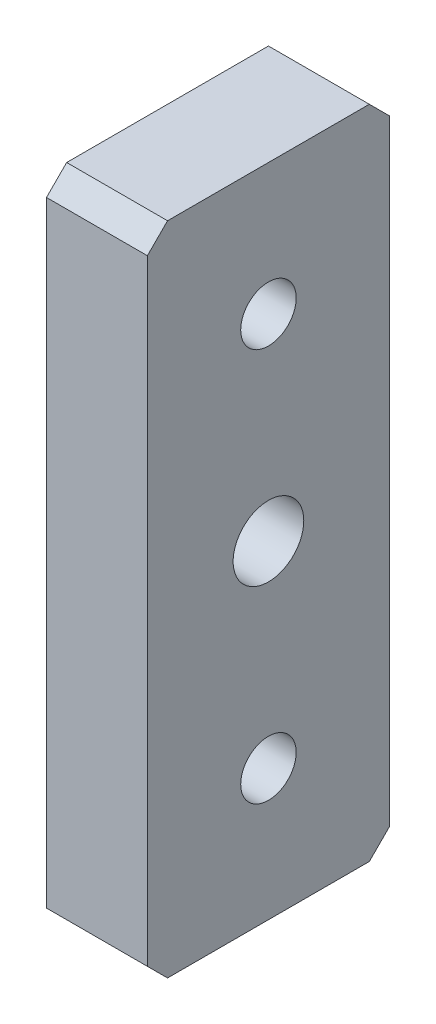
ISO-10303-21;
HEADER;
FILE_DESCRIPTION(('STEP AP214'),'2;1');
FILE_NAME('part.step','',(''),(''),'','','');
FILE_SCHEMA(('AUTOMOTIVE_DESIGN { 1 0 10303 214 1 1 1 1 }'));
ENDSEC;
DATA;
#1=APPLICATION_CONTEXT('core data for automotive mechanical design processes');
#2=APPLICATION_PROTOCOL_DEFINITION('international standard','automotive_design',2000,#1);
#3=PRODUCT_CONTEXT('',#1,'mechanical');
#4=PRODUCT('Part','Part','',(#3));
#5=PRODUCT_RELATED_PRODUCT_CATEGORY('part','',(#4));
#6=PRODUCT_DEFINITION_FORMATION('','',#4);
#7=PRODUCT_DEFINITION_CONTEXT('part definition',#1,'design');
#8=PRODUCT_DEFINITION('design','',#6,#7);
#9=PRODUCT_DEFINITION_SHAPE('','',#8);
#10=(LENGTH_UNIT() NAMED_UNIT(*) SI_UNIT(.MILLI.,.METRE.));
#11=(NAMED_UNIT(*) PLANE_ANGLE_UNIT() SI_UNIT($,.RADIAN.));
#12=(NAMED_UNIT(*) SI_UNIT($,.STERADIAN.) SOLID_ANGLE_UNIT());
#13=UNCERTAINTY_MEASURE_WITH_UNIT(LENGTH_MEASURE(1.E-05),#10,'distance_accuracy_value','');
#14=(GEOMETRIC_REPRESENTATION_CONTEXT(3) GLOBAL_UNCERTAINTY_ASSIGNED_CONTEXT((#13)) GLOBAL_UNIT_ASSIGNED_CONTEXT((#10,
#11,#12)) REPRESENTATION_CONTEXT('',''));
#15=CARTESIAN_POINT('',(0.,0.,0.));
#16=DIRECTION('',(0.,0.,1.));
#17=DIRECTION('',(1.,0.,0.));
#18=AXIS2_PLACEMENT_3D('',#15,#16,#17);
#19=CARTESIAN_POINT('',(0.,13.,0.));
#20=DIRECTION('',(-1.,0.,0.));
#21=DIRECTION('',(0.,0.,1.));
#22=AXIS2_PLACEMENT_3D('',#19,#20,#21);
#23=CYLINDRICAL_SURFACE('',#22,4.5);
#24=CARTESIAN_POINT('',(0.,13.,0.));
#25=DIRECTION('',(-1.,0.,0.));
#26=DIRECTION('',(0.,0.,1.));
#27=AXIS2_PLACEMENT_3D('',#24,#25,#26);
#28=CIRCLE('',#27,4.5);
#29=CARTESIAN_POINT('',(0.,13.,4.5));
#30=VERTEX_POINT('',#29);
#31=EDGE_CURVE('E20',#30,#30,#28,.T.);
#32=ORIENTED_EDGE('',*,*,#31,.F.);
#33=EDGE_LOOP('',(#32));
#34=FACE_BOUND('',#33,.T.);
#35=CARTESIAN_POINT('',(-5.,13.,0.));
#36=DIRECTION('',(-1.,0.,0.));
#37=DIRECTION('',(0.,0.,1.));
#38=AXIS2_PLACEMENT_3D('',#35,#36,#37);
#39=CIRCLE('',#38,4.5);
#40=CARTESIAN_POINT('',(-5.,13.,4.50000000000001));
#41=VERTEX_POINT('',#40);
#42=EDGE_CURVE('E130',#41,#41,#39,.T.);
#43=ORIENTED_EDGE('',*,*,#42,.T.);
#44=EDGE_LOOP('',(#43));
#45=FACE_BOUND('',#44,.T.);
#46=ADVANCED_FACE('F17',(#34,#45),#23,.F.);
#47=CARTESIAN_POINT('',(0.,52.,0.));
#48=DIRECTION('',(-1.,0.,0.));
#49=DIRECTION('',(0.,0.,1.));
#50=AXIS2_PLACEMENT_3D('',#47,#48,#49);
#51=CYLINDRICAL_SURFACE('',#50,4.5);
#52=CARTESIAN_POINT('',(0.,52.,0.));
#53=DIRECTION('',(-1.,0.,0.));
#54=DIRECTION('',(0.,0.,1.));
#55=AXIS2_PLACEMENT_3D('',#52,#53,#54);
#56=CIRCLE('',#55,4.5);
#57=CARTESIAN_POINT('',(0.,52.,4.5));
#58=VERTEX_POINT('',#57);
#59=EDGE_CURVE('E132',#58,#58,#56,.T.);
#60=ORIENTED_EDGE('',*,*,#59,.F.);
#61=EDGE_LOOP('',(#60));
#62=FACE_BOUND('',#61,.T.);
#63=CARTESIAN_POINT('',(-5.,52.,0.));
#64=DIRECTION('',(-1.,0.,0.));
#65=DIRECTION('',(0.,0.,1.));
#66=AXIS2_PLACEMENT_3D('',#63,#64,#65);
#67=CIRCLE('',#66,4.5);
#68=CARTESIAN_POINT('',(-5.,52.,4.5));
#69=VERTEX_POINT('',#68);
#70=EDGE_CURVE('E127',#69,#69,#67,.T.);
#71=ORIENTED_EDGE('',*,*,#70,.T.);
#72=EDGE_LOOP('',(#71));
#73=FACE_BOUND('',#72,.T.);
#74=ADVANCED_FACE('F143',(#62,#73),#51,.F.);
#75=CARTESIAN_POINT('',(0.,13.,0.));
#76=DIRECTION('',(-1.,0.,0.));
#77=DIRECTION('',(0.,0.,1.));
#78=AXIS2_PLACEMENT_3D('',#75,#76,#77);
#79=PLANE('',#78);
#80=CARTESIAN_POINT('',(0.,13.,0.));
#81=DIRECTION('',(-1.,0.,0.));
#82=DIRECTION('',(0.,0.,1.));
#83=AXIS2_PLACEMENT_3D('',#80,#81,#82);
#84=CIRCLE('',#83,2.75);
#85=CARTESIAN_POINT('',(0.,13.,2.75000000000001));
#86=VERTEX_POINT('',#85);
#87=EDGE_CURVE('E121',#86,#86,#84,.F.);
#88=ORIENTED_EDGE('',*,*,#87,.T.);
#89=EDGE_LOOP('',(#88));
#90=FACE_BOUND('',#89,.T.);
#91=ORIENTED_EDGE('',*,*,#31,.T.);
#92=EDGE_LOOP('',(#91));
#93=FACE_BOUND('',#92,.T.);
#94=ADVANCED_FACE('F139',(#90,#93),#79,.T.);
#95=CARTESIAN_POINT('',(0.,52.,0.));
#96=DIRECTION('',(-1.,0.,0.));
#97=DIRECTION('',(0.,0.,1.));
#98=AXIS2_PLACEMENT_3D('',#95,#96,#97);
#99=PLANE('',#98);
#100=CARTESIAN_POINT('',(0.,52.,0.));
#101=DIRECTION('',(-1.,0.,0.));
#102=DIRECTION('',(0.,0.,1.));
#103=AXIS2_PLACEMENT_3D('',#100,#101,#102);
#104=CIRCLE('',#103,2.75);
#105=CARTESIAN_POINT('',(0.,52.,2.75000000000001));
#106=VERTEX_POINT('',#105);
#107=EDGE_CURVE('E96',#106,#106,#104,.F.);
#108=ORIENTED_EDGE('',*,*,#107,.T.);
#109=EDGE_LOOP('',(#108));
#110=FACE_BOUND('',#109,.T.);
#111=ORIENTED_EDGE('',*,*,#59,.T.);
#112=EDGE_LOOP('',(#111));
#113=FACE_BOUND('',#112,.T.);
#114=ADVANCED_FACE('F149',(#110,#113),#99,.T.);
#115=CARTESIAN_POINT('',(-5.,65.,-12.));
#116=DIRECTION('',(1.,0.,0.));
#117=DIRECTION('',(0.,0.,-1.));
#118=AXIS2_PLACEMENT_3D('',#115,#116,#117);
#119=PLANE('',#118);
#120=DIRECTION('',(0.,-0.707106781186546,0.707106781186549));
#121=VECTOR('',#120,1.);
#122=CARTESIAN_POINT('',(-5.,2.,-12.));
#123=LINE('',#122,#121);
#124=CARTESIAN_POINT('',(-5.,2.00000000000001,-12.));
#125=VERTEX_POINT('',#124);
#126=CARTESIAN_POINT('',(-5.,0.,-9.99999999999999));
#127=VERTEX_POINT('',#126);
#128=EDGE_CURVE('E373',#125,#127,#123,.T.);
#129=ORIENTED_EDGE('',*,*,#128,.T.);
#130=DIRECTION('',(0.,0.,1.));
#131=VECTOR('',#130,1.);
#132=CARTESIAN_POINT('',(-5.,0.,0.));
#133=LINE('',#132,#131);
#134=CARTESIAN_POINT('',(-5.,0.,9.99999999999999));
#135=VERTEX_POINT('',#134);
#136=EDGE_CURVE('E90',#127,#135,#133,.T.);
#137=ORIENTED_EDGE('',*,*,#136,.T.);
#138=DIRECTION('',(0.,0.707106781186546,0.707106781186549));
#139=VECTOR('',#138,1.);
#140=CARTESIAN_POINT('',(-5.,2.,12.));
#141=LINE('',#140,#139);
#142=CARTESIAN_POINT('',(-5.,2.00000000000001,12.));
#143=VERTEX_POINT('',#142);
#144=EDGE_CURVE('E84',#135,#143,#141,.T.);
#145=ORIENTED_EDGE('',*,*,#144,.T.);
#146=DIRECTION('',(0.,1.,0.));
#147=VECTOR('',#146,1.);
#148=CARTESIAN_POINT('',(-5.,65.,12.));
#149=LINE('',#148,#147);
#150=CARTESIAN_POINT('',(-5.,63.,12.));
#151=VERTEX_POINT('',#150);
#152=EDGE_CURVE('E88',#143,#151,#149,.T.);
#153=ORIENTED_EDGE('',*,*,#152,.T.);
#154=DIRECTION('',(0.,-0.707106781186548,0.707106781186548));
#155=VECTOR('',#154,1.);
#156=CARTESIAN_POINT('',(-5.,65.,10.));
#157=LINE('',#156,#155);
#158=CARTESIAN_POINT('',(-5.,65.,9.99999999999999));
#159=VERTEX_POINT('',#158);
#160=EDGE_CURVE('E79',#159,#151,#157,.T.);
#161=ORIENTED_EDGE('',*,*,#160,.F.);
#162=DIRECTION('',(0.,0.,1.));
#163=VECTOR('',#162,1.);
#164=CARTESIAN_POINT('',(-5.,65.,0.));
#165=LINE('',#164,#163);
#166=CARTESIAN_POINT('',(-5.00000000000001,65.,-10.));
#167=VERTEX_POINT('',#166);
#168=EDGE_CURVE('E388',#167,#159,#165,.T.);
#169=ORIENTED_EDGE('',*,*,#168,.F.);
#170=DIRECTION('',(0.,0.707106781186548,0.707106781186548));
#171=VECTOR('',#170,1.);
#172=CARTESIAN_POINT('',(-5.00000000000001,65.,-10.));
#173=LINE('',#172,#171);
#174=CARTESIAN_POINT('',(-5.00000000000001,63.,-12.));
#175=VERTEX_POINT('',#174);
#176=EDGE_CURVE('E385',#175,#167,#173,.T.);
#177=ORIENTED_EDGE('',*,*,#176,.F.);
#178=DIRECTION('',(0.,1.,0.));
#179=VECTOR('',#178,1.);
#180=CARTESIAN_POINT('',(-5.,65.,-12.));
#181=LINE('',#180,#179);
#182=EDGE_CURVE('E378',#175,#125,#181,.F.);
#183=ORIENTED_EDGE('',*,*,#182,.T.);
#184=EDGE_LOOP('',(#129,#137,#145,#153,#161,#169,#177,#183));
#185=FACE_BOUND('',#184,.T.);
#186=ORIENTED_EDGE('',*,*,#70,.F.);
#187=EDGE_LOOP('',(#186));
#188=FACE_BOUND('',#187,.T.);
#189=ORIENTED_EDGE('',*,*,#42,.F.);
#190=EDGE_LOOP('',(#189));
#191=FACE_BOUND('',#190,.T.);
#192=CARTESIAN_POINT('',(-5.00000000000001,32.5,0.));
#193=DIRECTION('',(1.,0.,0.));
#194=DIRECTION('',(0.,0.,-1.));
#195=AXIS2_PLACEMENT_3D('',#192,#193,#194);
#196=CIRCLE('',#195,3.5);
#197=CARTESIAN_POINT('',(-5.00000000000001,32.5,-3.5));
#198=VERTEX_POINT('',#197);
#199=EDGE_CURVE('E124',#198,#198,#196,.T.);
#200=ORIENTED_EDGE('',*,*,#199,.T.);
#201=EDGE_LOOP('',(#200));
#202=FACE_BOUND('',#201,.T.);
#203=ADVANCED_FACE('F86',(#185,#188,#191,#202),#119,.F.);
#204=CARTESIAN_POINT('',(5.,32.5,0.));
#205=DIRECTION('',(1.,0.,0.));
#206=DIRECTION('',(0.,0.,-1.));
#207=AXIS2_PLACEMENT_3D('',#204,#205,#206);
#208=CYLINDRICAL_SURFACE('',#207,3.5);
#209=ORIENTED_EDGE('',*,*,#199,.F.);
#210=EDGE_LOOP('',(#209));
#211=FACE_BOUND('',#210,.T.);
#212=CARTESIAN_POINT('',(5.,32.5,0.));
#213=DIRECTION('',(1.,0.,0.));
#214=DIRECTION('',(0.,0.,-1.));
#215=AXIS2_PLACEMENT_3D('',#212,#213,#214);
#216=CIRCLE('',#215,3.5);
#217=CARTESIAN_POINT('',(5.,32.5,-3.5));
#218=VERTEX_POINT('',#217);
#219=EDGE_CURVE('E116',#218,#218,#216,.T.);
#220=ORIENTED_EDGE('',*,*,#219,.T.);
#221=EDGE_LOOP('',(#220));
#222=FACE_BOUND('',#221,.T.);
#223=ADVANCED_FACE('F148',(#211,#222),#208,.F.);
#224=CARTESIAN_POINT('',(5.,13.,0.));
#225=DIRECTION('',(-1.,0.,0.));
#226=DIRECTION('',(0.,0.,1.));
#227=AXIS2_PLACEMENT_3D('',#224,#225,#226);
#228=CYLINDRICAL_SURFACE('',#227,2.75);
#229=CARTESIAN_POINT('',(5.,13.,0.));
#230=DIRECTION('',(-1.,0.,0.));
#231=DIRECTION('',(0.,0.,1.));
#232=AXIS2_PLACEMENT_3D('',#229,#230,#231);
#233=CIRCLE('',#232,2.75);
#234=CARTESIAN_POINT('',(5.,13.,2.75000000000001));
#235=VERTEX_POINT('',#234);
#236=EDGE_CURVE('E113',#235,#235,#233,.F.);
#237=ORIENTED_EDGE('',*,*,#236,.T.);
#238=EDGE_LOOP('',(#237));
#239=FACE_BOUND('',#238,.T.);
#240=ORIENTED_EDGE('',*,*,#87,.F.);
#241=EDGE_LOOP('',(#240));
#242=FACE_BOUND('',#241,.T.);
#243=ADVANCED_FACE('F155',(#239,#242),#228,.F.);
#244=CARTESIAN_POINT('',(5.,52.,0.));
#245=DIRECTION('',(-1.,0.,0.));
#246=DIRECTION('',(0.,0.,1.));
#247=AXIS2_PLACEMENT_3D('',#244,#245,#246);
#248=CYLINDRICAL_SURFACE('',#247,2.75);
#249=CARTESIAN_POINT('',(5.,52.,0.));
#250=DIRECTION('',(-1.,0.,0.));
#251=DIRECTION('',(0.,0.,1.));
#252=AXIS2_PLACEMENT_3D('',#249,#250,#251);
#253=CIRCLE('',#252,2.75);
#254=CARTESIAN_POINT('',(5.,52.,2.75000000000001));
#255=VERTEX_POINT('',#254);
#256=EDGE_CURVE('E110',#255,#255,#253,.F.);
#257=ORIENTED_EDGE('',*,*,#256,.T.);
#258=EDGE_LOOP('',(#257));
#259=FACE_BOUND('',#258,.T.);
#260=ORIENTED_EDGE('',*,*,#107,.F.);
#261=EDGE_LOOP('',(#260));
#262=FACE_BOUND('',#261,.T.);
#263=ADVANCED_FACE('F195',(#259,#262),#248,.F.);
#264=CARTESIAN_POINT('',(-5.,2.,12.));
#265=DIRECTION('',(0.,0.707106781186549,-0.707106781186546));
#266=DIRECTION('',(0.,0.707106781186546,0.707106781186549));
#267=AXIS2_PLACEMENT_3D('',#264,#265,#266);
#268=PLANE('',#267);
#269=DIRECTION('',(1.,0.,0.));
#270=VECTOR('',#269,1.);
#271=CARTESIAN_POINT('',(0.,0.,9.99999999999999));
#272=LINE('',#271,#270);
#273=CARTESIAN_POINT('',(5.,0.,9.99999999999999));
#274=VERTEX_POINT('',#273);
#275=EDGE_CURVE('E371',#135,#274,#272,.T.);
#276=ORIENTED_EDGE('',*,*,#275,.T.);
#277=DIRECTION('',(0.,0.707106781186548,0.707106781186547));
#278=VECTOR('',#277,1.);
#279=CARTESIAN_POINT('',(5.,0.,9.99999999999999));
#280=LINE('',#279,#278);
#281=CARTESIAN_POINT('',(5.,2.00000000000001,12.));
#282=VERTEX_POINT('',#281);
#283=EDGE_CURVE('E106',#274,#282,#280,.T.);
#284=ORIENTED_EDGE('',*,*,#283,.T.);
#285=DIRECTION('',(-1.,0.,0.));
#286=VECTOR('',#285,1.);
#287=CARTESIAN_POINT('',(-5.,2.00000000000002,12.));
#288=LINE('',#287,#286);
#289=EDGE_CURVE('E95',#282,#143,#288,.T.);
#290=ORIENTED_EDGE('',*,*,#289,.T.);
#291=ORIENTED_EDGE('',*,*,#144,.F.);
#292=EDGE_LOOP('',(#276,#284,#290,#291));
#293=FACE_BOUND('',#292,.T.);
#294=ADVANCED_FACE('F105',(#293),#268,.F.);
#295=CARTESIAN_POINT('',(-5.,65.,12.));
#296=DIRECTION('',(0.,0.,-1.));
#297=DIRECTION('',(-1.,0.,0.));
#298=AXIS2_PLACEMENT_3D('',#295,#296,#297);
#299=PLANE('',#298);
#300=ORIENTED_EDGE('',*,*,#289,.F.);
#301=DIRECTION('',(0.,1.,0.));
#302=VECTOR('',#301,1.);
#303=CARTESIAN_POINT('',(5.,65.,12.));
#304=LINE('',#303,#302);
#305=CARTESIAN_POINT('',(5.,63.,12.));
#306=VERTEX_POINT('',#305);
#307=EDGE_CURVE('E360',#282,#306,#304,.T.);
#308=ORIENTED_EDGE('',*,*,#307,.T.);
#309=DIRECTION('',(1.,0.,0.));
#310=VECTOR('',#309,1.);
#311=CARTESIAN_POINT('',(0.,63.,12.));
#312=LINE('',#311,#310);
#313=EDGE_CURVE('E102',#151,#306,#312,.T.);
#314=ORIENTED_EDGE('',*,*,#313,.F.);
#315=ORIENTED_EDGE('',*,*,#152,.F.);
#316=EDGE_LOOP('',(#300,#308,#314,#315));
#317=FACE_BOUND('',#316,.T.);
#318=ADVANCED_FACE('F99',(#317),#299,.F.);
#319=CARTESIAN_POINT('',(0.,65.,10.));
#320=DIRECTION('',(0.,0.707106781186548,0.707106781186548));
#321=DIRECTION('',(0.,-0.707106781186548,0.707106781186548));
#322=AXIS2_PLACEMENT_3D('',#319,#320,#321);
#323=PLANE('',#322);
#324=DIRECTION('',(0.,0.707106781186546,-0.707106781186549));
#325=VECTOR('',#324,1.);
#326=CARTESIAN_POINT('',(5.,63.,12.));
#327=LINE('',#326,#325);
#328=CARTESIAN_POINT('',(5.,65.,9.99999999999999));
#329=VERTEX_POINT('',#328);
#330=EDGE_CURVE('E356',#306,#329,#327,.T.);
#331=ORIENTED_EDGE('',*,*,#330,.T.);
#332=DIRECTION('',(1.,0.,0.));
#333=VECTOR('',#332,1.);
#334=CARTESIAN_POINT('',(0.,65.,9.99999999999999));
#335=LINE('',#334,#333);
#336=EDGE_CURVE('E357',#159,#329,#335,.T.);
#337=ORIENTED_EDGE('',*,*,#336,.F.);
#338=ORIENTED_EDGE('',*,*,#160,.T.);
#339=ORIENTED_EDGE('',*,*,#313,.T.);
#340=EDGE_LOOP('',(#331,#337,#338,#339));
#341=FACE_BOUND('',#340,.T.);
#342=ADVANCED_FACE('F187',(#341),#323,.T.);
#343=CARTESIAN_POINT('',(0.,65.,0.));
#344=DIRECTION('',(0.,1.,0.));
#345=DIRECTION('',(0.,0.,1.));
#346=AXIS2_PLACEMENT_3D('',#343,#344,#345);
#347=PLANE('',#346);
#348=ORIENTED_EDGE('',*,*,#168,.T.);
#349=ORIENTED_EDGE('',*,*,#336,.T.);
#350=DIRECTION('',(0.,0.,1.));
#351=VECTOR('',#350,1.);
#352=CARTESIAN_POINT('',(5.,65.,-12.));
#353=LINE('',#352,#351);
#354=CARTESIAN_POINT('',(5.,65.,-10.));
#355=VERTEX_POINT('',#354);
#356=EDGE_CURVE('E359',#329,#355,#353,.F.);
#357=ORIENTED_EDGE('',*,*,#356,.T.);
#358=DIRECTION('',(1.,0.,0.));
#359=VECTOR('',#358,1.);
#360=CARTESIAN_POINT('',(0.,65.,-10.));
#361=LINE('',#360,#359);
#362=EDGE_CURVE('E383',#167,#355,#361,.T.);
#363=ORIENTED_EDGE('',*,*,#362,.F.);
#364=EDGE_LOOP('',(#348,#349,#357,#363));
#365=FACE_BOUND('',#364,.T.);
#366=ADVANCED_FACE('F183',(#365),#347,.T.);
#367=CARTESIAN_POINT('',(0.,65.,-10.));
#368=DIRECTION('',(0.,0.707106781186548,-0.707106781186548));
#369=DIRECTION('',(0.,0.707106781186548,0.707106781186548));
#370=AXIS2_PLACEMENT_3D('',#367,#368,#369);
#371=PLANE('',#370);
#372=ORIENTED_EDGE('',*,*,#176,.T.);
#373=ORIENTED_EDGE('',*,*,#362,.T.);
#374=DIRECTION('',(0.,-0.707106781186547,-0.707106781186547));
#375=VECTOR('',#374,1.);
#376=CARTESIAN_POINT('',(5.,65.,-10.));
#377=LINE('',#376,#375);
#378=CARTESIAN_POINT('',(5.,63.,-12.));
#379=VERTEX_POINT('',#378);
#380=EDGE_CURVE('E363',#355,#379,#377,.T.);
#381=ORIENTED_EDGE('',*,*,#380,.T.);
#382=DIRECTION('',(1.,0.,0.));
#383=VECTOR('',#382,1.);
#384=CARTESIAN_POINT('',(-5.,63.,-12.));
#385=LINE('',#384,#383);
#386=EDGE_CURVE('E380',#379,#175,#385,.F.);
#387=ORIENTED_EDGE('',*,*,#386,.T.);
#388=EDGE_LOOP('',(#372,#373,#381,#387));
#389=FACE_BOUND('',#388,.T.);
#390=ADVANCED_FACE('F179',(#389),#371,.T.);
#391=CARTESIAN_POINT('',(-5.,65.,-12.));
#392=DIRECTION('',(0.,0.,1.));
#393=DIRECTION('',(1.,0.,0.));
#394=AXIS2_PLACEMENT_3D('',#391,#392,#393);
#395=PLANE('',#394);
#396=DIRECTION('',(1.,0.,0.));
#397=VECTOR('',#396,1.);
#398=CARTESIAN_POINT('',(-5.,2.00000000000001,-12.));
#399=LINE('',#398,#397);
#400=CARTESIAN_POINT('',(5.,2.00000000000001,-12.));
#401=VERTEX_POINT('',#400);
#402=EDGE_CURVE('E375',#401,#125,#399,.F.);
#403=ORIENTED_EDGE('',*,*,#402,.T.);
#404=ORIENTED_EDGE('',*,*,#182,.F.);
#405=ORIENTED_EDGE('',*,*,#386,.F.);
#406=DIRECTION('',(0.,1.,0.));
#407=VECTOR('',#406,1.);
#408=CARTESIAN_POINT('',(5.,65.,-12.));
#409=LINE('',#408,#407);
#410=EDGE_CURVE('E398',#379,#401,#409,.F.);
#411=ORIENTED_EDGE('',*,*,#410,.T.);
#412=EDGE_LOOP('',(#403,#404,#405,#411));
#413=FACE_BOUND('',#412,.T.);
#414=ADVANCED_FACE('F175',(#413),#395,.F.);
#415=CARTESIAN_POINT('',(-5.,2.,-12.));
#416=DIRECTION('',(0.,0.707106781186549,0.707106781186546));
#417=DIRECTION('',(0.,-0.707106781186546,0.707106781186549));
#418=AXIS2_PLACEMENT_3D('',#415,#416,#417);
#419=PLANE('',#418);
#420=DIRECTION('',(1.,0.,0.));
#421=VECTOR('',#420,1.);
#422=CARTESIAN_POINT('',(0.,0.,-9.99999999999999));
#423=LINE('',#422,#421);
#424=CARTESIAN_POINT('',(5.,0.,-9.99999999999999));
#425=VERTEX_POINT('',#424);
#426=EDGE_CURVE('E34',#425,#127,#423,.F.);
#427=ORIENTED_EDGE('',*,*,#426,.T.);
#428=ORIENTED_EDGE('',*,*,#128,.F.);
#429=ORIENTED_EDGE('',*,*,#402,.F.);
#430=DIRECTION('',(0.,-0.707106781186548,0.707106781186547));
#431=VECTOR('',#430,1.);
#432=CARTESIAN_POINT('',(5.,2.00000000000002,-12.));
#433=LINE('',#432,#431);
#434=EDGE_CURVE('E26',#401,#425,#433,.T.);
#435=ORIENTED_EDGE('',*,*,#434,.T.);
#436=EDGE_LOOP('',(#427,#428,#429,#435));
#437=FACE_BOUND('',#436,.T.);
#438=ADVANCED_FACE('F168',(#437),#419,.F.);
#439=CARTESIAN_POINT('',(0.,0.,0.));
#440=DIRECTION('',(0.,1.,0.));
#441=DIRECTION('',(0.,0.,1.));
#442=AXIS2_PLACEMENT_3D('',#439,#440,#441);
#443=PLANE('',#442);
#444=ORIENTED_EDGE('',*,*,#426,.F.);
#445=DIRECTION('',(0.,0.,1.));
#446=VECTOR('',#445,1.);
#447=CARTESIAN_POINT('',(5.,0.,-12.));
#448=LINE('',#447,#446);
#449=EDGE_CURVE('E11',#425,#274,#448,.T.);
#450=ORIENTED_EDGE('',*,*,#449,.T.);
#451=ORIENTED_EDGE('',*,*,#275,.F.);
#452=ORIENTED_EDGE('',*,*,#136,.F.);
#453=EDGE_LOOP('',(#444,#450,#451,#452));
#454=FACE_BOUND('',#453,.T.);
#455=ADVANCED_FACE('F161',(#454),#443,.F.);
#456=CARTESIAN_POINT('',(5.,65.,-12.));
#457=DIRECTION('',(-1.,0.,0.));
#458=DIRECTION('',(0.,0.,1.));
#459=AXIS2_PLACEMENT_3D('',#456,#457,#458);
#460=PLANE('',#459);
#461=ORIENTED_EDGE('',*,*,#434,.F.);
#462=ORIENTED_EDGE('',*,*,#410,.F.);
#463=ORIENTED_EDGE('',*,*,#380,.F.);
#464=ORIENTED_EDGE('',*,*,#356,.F.);
#465=ORIENTED_EDGE('',*,*,#330,.F.);
#466=ORIENTED_EDGE('',*,*,#307,.F.);
#467=ORIENTED_EDGE('',*,*,#283,.F.);
#468=ORIENTED_EDGE('',*,*,#449,.F.);
#469=EDGE_LOOP('',(#461,#462,#463,#464,#465,#466,#467,#468));
#470=FACE_BOUND('',#469,.T.);
#471=ORIENTED_EDGE('',*,*,#256,.F.);
#472=EDGE_LOOP('',(#471));
#473=FACE_BOUND('',#472,.T.);
#474=ORIENTED_EDGE('',*,*,#236,.F.);
#475=EDGE_LOOP('',(#474));
#476=FACE_BOUND('',#475,.T.);
#477=ORIENTED_EDGE('',*,*,#219,.F.);
#478=EDGE_LOOP('',(#477));
#479=FACE_BOUND('',#478,.T.);
#480=ADVANCED_FACE('F159',(#470,#473,#476,#479),#460,.F.);
#481=CLOSED_SHELL('',(#46,#74,#94,#114,#203,#223,#243,#263,#294,#318,#342,#366,#390,#414,#438,
#455,#480));
#482=MANIFOLD_SOLID_BREP('B1',#481);
#483=ADVANCED_BREP_SHAPE_REPRESENTATION('',(#18,#482),#14);
#484=SHAPE_DEFINITION_REPRESENTATION(#9,#483);
ENDSEC;
END-ISO-10303-21;
